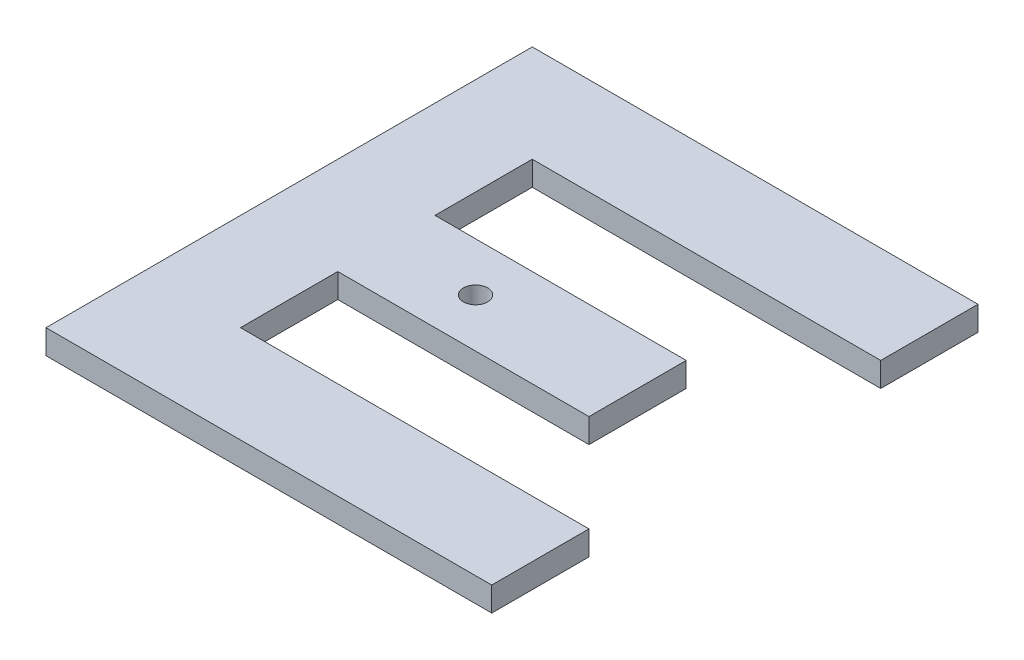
ISO-10303-21;
HEADER;
FILE_DESCRIPTION(('STEP AP214'),'2;1');
FILE_NAME('part.step','',(''),(''),'','','');
FILE_SCHEMA(('AUTOMOTIVE_DESIGN { 1 0 10303 214 1 1 1 1 }'));
ENDSEC;
DATA;
#1=APPLICATION_CONTEXT('core data for automotive mechanical design processes');
#2=APPLICATION_PROTOCOL_DEFINITION('international standard','automotive_design',2000,#1);
#3=PRODUCT_CONTEXT('',#1,'mechanical');
#4=PRODUCT('Part','Part','',(#3));
#5=PRODUCT_RELATED_PRODUCT_CATEGORY('part','',(#4));
#6=PRODUCT_DEFINITION_FORMATION('','',#4);
#7=PRODUCT_DEFINITION_CONTEXT('part definition',#1,'design');
#8=PRODUCT_DEFINITION('design','',#6,#7);
#9=PRODUCT_DEFINITION_SHAPE('','',#8);
#10=(LENGTH_UNIT() NAMED_UNIT(*) SI_UNIT(.MILLI.,.METRE.));
#11=(NAMED_UNIT(*) PLANE_ANGLE_UNIT() SI_UNIT($,.RADIAN.));
#12=(NAMED_UNIT(*) SI_UNIT($,.STERADIAN.) SOLID_ANGLE_UNIT());
#13=UNCERTAINTY_MEASURE_WITH_UNIT(LENGTH_MEASURE(1.E-05),#10,'distance_accuracy_value','');
#14=(GEOMETRIC_REPRESENTATION_CONTEXT(3) GLOBAL_UNCERTAINTY_ASSIGNED_CONTEXT((#13)) GLOBAL_UNIT_ASSIGNED_CONTEXT((#10,
#11,#12)) REPRESENTATION_CONTEXT('',''));
#15=CARTESIAN_POINT('',(0.,0.,0.));
#16=DIRECTION('',(0.,0.,1.));
#17=DIRECTION('',(1.,0.,0.));
#18=AXIS2_PLACEMENT_3D('',#15,#16,#17);
#19=CARTESIAN_POINT('',(0.,3.,-60.));
#20=DIRECTION('',(0.,-1.,0.));
#21=DIRECTION('',(0.,0.,-1.));
#22=AXIS2_PLACEMENT_3D('',#19,#20,#21);
#23=PLANE('',#22);
#24=DIRECTION('',(0.,0.,1.));
#25=VECTOR('',#24,1.);
#26=CARTESIAN_POINT('',(0.,3.,0.));
#27=LINE('',#26,#25);
#28=CARTESIAN_POINT('',(0.,3.,-60.));
#29=VERTEX_POINT('',#28);
#30=CARTESIAN_POINT('',(0.,3.,0.));
#31=VERTEX_POINT('',#30);
#32=EDGE_CURVE('E164',#29,#31,#27,.T.);
#33=ORIENTED_EDGE('',*,*,#32,.T.);
#34=DIRECTION('',(1.,0.,0.));
#35=VECTOR('',#34,1.);
#36=CARTESIAN_POINT('',(0.,3.,0.));
#37=LINE('',#36,#35);
#38=CARTESIAN_POINT('',(55.,3.,0.));
#39=VERTEX_POINT('',#38);
#40=EDGE_CURVE('E133',#31,#39,#37,.T.);
#41=ORIENTED_EDGE('',*,*,#40,.T.);
#42=DIRECTION('',(0.,0.,-1.));
#43=VECTOR('',#42,1.);
#44=CARTESIAN_POINT('',(55.,3.,0.));
#45=LINE('',#44,#43);
#46=CARTESIAN_POINT('',(55.,3.,-12.));
#47=VERTEX_POINT('',#46);
#48=EDGE_CURVE('E167',#39,#47,#45,.T.);
#49=ORIENTED_EDGE('',*,*,#48,.T.);
#50=DIRECTION('',(-1.,0.,0.));
#51=VECTOR('',#50,1.);
#52=CARTESIAN_POINT('',(12.,3.,-12.));
#53=LINE('',#52,#51);
#54=CARTESIAN_POINT('',(12.,3.,-12.));
#55=VERTEX_POINT('',#54);
#56=EDGE_CURVE('E169',#47,#55,#53,.T.);
#57=ORIENTED_EDGE('',*,*,#56,.T.);
#58=DIRECTION('',(0.,0.,-1.));
#59=VECTOR('',#58,1.);
#60=CARTESIAN_POINT('',(12.,3.,-12.));
#61=LINE('',#60,#59);
#62=CARTESIAN_POINT('',(12.,3.,-24.));
#63=VERTEX_POINT('',#62);
#64=EDGE_CURVE('E171',#55,#63,#61,.T.);
#65=ORIENTED_EDGE('',*,*,#64,.T.);
#66=DIRECTION('',(1.,0.,0.));
#67=VECTOR('',#66,1.);
#68=CARTESIAN_POINT('',(12.,3.,-24.));
#69=LINE('',#68,#67);
#70=CARTESIAN_POINT('',(43.,3.,-24.));
#71=VERTEX_POINT('',#70);
#72=EDGE_CURVE('E173',#63,#71,#69,.T.);
#73=ORIENTED_EDGE('',*,*,#72,.T.);
#74=DIRECTION('',(0.,0.,-1.));
#75=VECTOR('',#74,1.);
#76=CARTESIAN_POINT('',(43.,3.,-24.));
#77=LINE('',#76,#75);
#78=CARTESIAN_POINT('',(43.,3.,-36.));
#79=VERTEX_POINT('',#78);
#80=EDGE_CURVE('E175',#71,#79,#77,.T.);
#81=ORIENTED_EDGE('',*,*,#80,.T.);
#82=DIRECTION('',(-1.,0.,0.));
#83=VECTOR('',#82,1.);
#84=CARTESIAN_POINT('',(12.,3.,-36.));
#85=LINE('',#84,#83);
#86=CARTESIAN_POINT('',(12.,3.,-36.));
#87=VERTEX_POINT('',#86);
#88=EDGE_CURVE('E177',#79,#87,#85,.T.);
#89=ORIENTED_EDGE('',*,*,#88,.T.);
#90=DIRECTION('',(0.,0.,-1.));
#91=VECTOR('',#90,1.);
#92=CARTESIAN_POINT('',(12.,3.,-36.));
#93=LINE('',#92,#91);
#94=CARTESIAN_POINT('',(12.,3.,-48.));
#95=VERTEX_POINT('',#94);
#96=EDGE_CURVE('E179',#87,#95,#93,.T.);
#97=ORIENTED_EDGE('',*,*,#96,.T.);
#98=DIRECTION('',(1.,0.,0.));
#99=VECTOR('',#98,1.);
#100=CARTESIAN_POINT('',(12.,3.,-48.));
#101=LINE('',#100,#99);
#102=CARTESIAN_POINT('',(55.,3.,-48.));
#103=VERTEX_POINT('',#102);
#104=EDGE_CURVE('E181',#95,#103,#101,.T.);
#105=ORIENTED_EDGE('',*,*,#104,.T.);
#106=DIRECTION('',(0.,0.,-1.));
#107=VECTOR('',#106,1.);
#108=CARTESIAN_POINT('',(55.,3.,-48.));
#109=LINE('',#108,#107);
#110=CARTESIAN_POINT('',(55.,3.,-60.));
#111=VERTEX_POINT('',#110);
#112=EDGE_CURVE('E50',#103,#111,#109,.T.);
#113=ORIENTED_EDGE('',*,*,#112,.T.);
#114=DIRECTION('',(-1.,0.,0.));
#115=VECTOR('',#114,1.);
#116=CARTESIAN_POINT('',(0.,3.,-60.));
#117=LINE('',#116,#115);
#118=EDGE_CURVE('E45',#111,#29,#117,.T.);
#119=ORIENTED_EDGE('',*,*,#118,.T.);
#120=EDGE_LOOP('',(#33,#41,#49,#57,#65,#73,#81,#89,#97,#105,#113,#119));
#121=FACE_BOUND('',#120,.T.);
#122=CARTESIAN_POINT('',(23.,3.,-30.));
#123=DIRECTION('',(0.,1.,0.));
#124=DIRECTION('',(0.,0.,1.));
#125=AXIS2_PLACEMENT_3D('',#122,#123,#124);
#126=CIRCLE('',#125,1.5);
#127=CARTESIAN_POINT('',(23.,3.,-28.5));
#128=VERTEX_POINT('',#127);
#129=EDGE_CURVE('E138',#128,#128,#126,.T.);
#130=ORIENTED_EDGE('',*,*,#129,.F.);
#131=EDGE_LOOP('',(#130));
#132=FACE_BOUND('',#131,.T.);
#133=ADVANCED_FACE('F30',(#121,#132),#23,.F.);
#134=CARTESIAN_POINT('',(0.,0.,-60.));
#135=DIRECTION('',(0.,-1.,0.));
#136=DIRECTION('',(0.,0.,-1.));
#137=AXIS2_PLACEMENT_3D('',#134,#135,#136);
#138=PLANE('',#137);
#139=DIRECTION('',(0.,0.,1.));
#140=VECTOR('',#139,1.);
#141=CARTESIAN_POINT('',(0.,0.,0.));
#142=LINE('',#141,#140);
#143=CARTESIAN_POINT('',(0.,0.,-60.));
#144=VERTEX_POINT('',#143);
#145=CARTESIAN_POINT('',(0.,0.,0.));
#146=VERTEX_POINT('',#145);
#147=EDGE_CURVE('E124',#144,#146,#142,.T.);
#148=ORIENTED_EDGE('',*,*,#147,.F.);
#149=DIRECTION('',(-1.,0.,0.));
#150=VECTOR('',#149,1.);
#151=CARTESIAN_POINT('',(0.,0.,-60.));
#152=LINE('',#151,#150);
#153=CARTESIAN_POINT('',(55.,0.,-60.));
#154=VERTEX_POINT('',#153);
#155=EDGE_CURVE('E162',#154,#144,#152,.T.);
#156=ORIENTED_EDGE('',*,*,#155,.F.);
#157=DIRECTION('',(0.,0.,-1.));
#158=VECTOR('',#157,1.);
#159=CARTESIAN_POINT('',(55.,0.,-48.));
#160=LINE('',#159,#158);
#161=CARTESIAN_POINT('',(55.,0.,-48.));
#162=VERTEX_POINT('',#161);
#163=EDGE_CURVE('E160',#162,#154,#160,.T.);
#164=ORIENTED_EDGE('',*,*,#163,.F.);
#165=DIRECTION('',(1.,0.,0.));
#166=VECTOR('',#165,1.);
#167=CARTESIAN_POINT('',(12.,0.,-48.));
#168=LINE('',#167,#166);
#169=CARTESIAN_POINT('',(12.,0.,-48.));
#170=VERTEX_POINT('',#169);
#171=EDGE_CURVE('E158',#170,#162,#168,.T.);
#172=ORIENTED_EDGE('',*,*,#171,.F.);
#173=DIRECTION('',(0.,0.,-1.));
#174=VECTOR('',#173,1.);
#175=CARTESIAN_POINT('',(12.,0.,-36.));
#176=LINE('',#175,#174);
#177=CARTESIAN_POINT('',(12.,0.,-36.));
#178=VERTEX_POINT('',#177);
#179=EDGE_CURVE('E156',#178,#170,#176,.T.);
#180=ORIENTED_EDGE('',*,*,#179,.F.);
#181=DIRECTION('',(-1.,0.,0.));
#182=VECTOR('',#181,1.);
#183=CARTESIAN_POINT('',(12.,0.,-36.));
#184=LINE('',#183,#182);
#185=CARTESIAN_POINT('',(43.,0.,-36.));
#186=VERTEX_POINT('',#185);
#187=EDGE_CURVE('E154',#186,#178,#184,.T.);
#188=ORIENTED_EDGE('',*,*,#187,.F.);
#189=DIRECTION('',(0.,0.,-1.));
#190=VECTOR('',#189,1.);
#191=CARTESIAN_POINT('',(43.,0.,-24.));
#192=LINE('',#191,#190);
#193=CARTESIAN_POINT('',(43.,0.,-24.));
#194=VERTEX_POINT('',#193);
#195=EDGE_CURVE('E152',#194,#186,#192,.T.);
#196=ORIENTED_EDGE('',*,*,#195,.F.);
#197=DIRECTION('',(1.,0.,0.));
#198=VECTOR('',#197,1.);
#199=CARTESIAN_POINT('',(12.,0.,-24.));
#200=LINE('',#199,#198);
#201=CARTESIAN_POINT('',(12.,0.,-24.));
#202=VERTEX_POINT('',#201);
#203=EDGE_CURVE('E150',#202,#194,#200,.T.);
#204=ORIENTED_EDGE('',*,*,#203,.F.);
#205=DIRECTION('',(0.,0.,-1.));
#206=VECTOR('',#205,1.);
#207=CARTESIAN_POINT('',(12.,0.,-12.));
#208=LINE('',#207,#206);
#209=CARTESIAN_POINT('',(12.,0.,-12.));
#210=VERTEX_POINT('',#209);
#211=EDGE_CURVE('E148',#210,#202,#208,.T.);
#212=ORIENTED_EDGE('',*,*,#211,.F.);
#213=DIRECTION('',(-1.,0.,0.));
#214=VECTOR('',#213,1.);
#215=CARTESIAN_POINT('',(12.,0.,-12.));
#216=LINE('',#215,#214);
#217=CARTESIAN_POINT('',(55.,0.,-12.));
#218=VERTEX_POINT('',#217);
#219=EDGE_CURVE('E146',#218,#210,#216,.T.);
#220=ORIENTED_EDGE('',*,*,#219,.F.);
#221=DIRECTION('',(0.,0.,-1.));
#222=VECTOR('',#221,1.);
#223=CARTESIAN_POINT('',(55.,0.,0.));
#224=LINE('',#223,#222);
#225=CARTESIAN_POINT('',(55.,0.,0.));
#226=VERTEX_POINT('',#225);
#227=EDGE_CURVE('E126',#226,#218,#224,.T.);
#228=ORIENTED_EDGE('',*,*,#227,.F.);
#229=DIRECTION('',(1.,0.,0.));
#230=VECTOR('',#229,1.);
#231=CARTESIAN_POINT('',(0.,0.,0.));
#232=LINE('',#231,#230);
#233=EDGE_CURVE('E119',#146,#226,#232,.T.);
#234=ORIENTED_EDGE('',*,*,#233,.F.);
#235=EDGE_LOOP('',(#148,#156,#164,#172,#180,#188,#196,#204,#212,#220,#228,#234));
#236=FACE_BOUND('',#235,.T.);
#237=CARTESIAN_POINT('',(23.,0.,-30.));
#238=DIRECTION('',(0.,1.,0.));
#239=DIRECTION('',(0.,0.,1.));
#240=AXIS2_PLACEMENT_3D('',#237,#238,#239);
#241=CIRCLE('',#240,1.5);
#242=CARTESIAN_POINT('',(23.,0.,-28.5));
#243=VERTEX_POINT('',#242);
#244=EDGE_CURVE('E141',#243,#243,#241,.T.);
#245=ORIENTED_EDGE('',*,*,#244,.T.);
#246=EDGE_LOOP('',(#245));
#247=FACE_BOUND('',#246,.T.);
#248=ADVANCED_FACE('F120',(#236,#247),#138,.T.);
#249=CARTESIAN_POINT('',(0.,3.,0.));
#250=DIRECTION('',(1.,0.,0.));
#251=DIRECTION('',(0.,0.,-1.));
#252=AXIS2_PLACEMENT_3D('',#249,#250,#251);
#253=PLANE('',#252);
#254=ORIENTED_EDGE('',*,*,#147,.T.);
#255=DIRECTION('',(0.,-1.,0.));
#256=VECTOR('',#255,1.);
#257=CARTESIAN_POINT('',(0.,3.,0.));
#258=LINE('',#257,#256);
#259=EDGE_CURVE('E11',#31,#146,#258,.T.);
#260=ORIENTED_EDGE('',*,*,#259,.F.);
#261=ORIENTED_EDGE('',*,*,#32,.F.);
#262=DIRECTION('',(0.,-1.,0.));
#263=VECTOR('',#262,1.);
#264=CARTESIAN_POINT('',(0.,3.,-60.));
#265=LINE('',#264,#263);
#266=EDGE_CURVE('E137',#29,#144,#265,.T.);
#267=ORIENTED_EDGE('',*,*,#266,.T.);
#268=EDGE_LOOP('',(#254,#260,#261,#267));
#269=FACE_BOUND('',#268,.T.);
#270=ADVANCED_FACE('F32',(#269),#253,.F.);
#271=CARTESIAN_POINT('',(0.,3.,0.));
#272=DIRECTION('',(0.,0.,-1.));
#273=DIRECTION('',(-1.,0.,0.));
#274=AXIS2_PLACEMENT_3D('',#271,#272,#273);
#275=PLANE('',#274);
#276=ORIENTED_EDGE('',*,*,#233,.T.);
#277=DIRECTION('',(0.,-1.,0.));
#278=VECTOR('',#277,1.);
#279=CARTESIAN_POINT('',(55.,3.,0.));
#280=LINE('',#279,#278);
#281=EDGE_CURVE('E38',#39,#226,#280,.T.);
#282=ORIENTED_EDGE('',*,*,#281,.F.);
#283=ORIENTED_EDGE('',*,*,#40,.F.);
#284=ORIENTED_EDGE('',*,*,#259,.T.);
#285=EDGE_LOOP('',(#276,#282,#283,#284));
#286=FACE_BOUND('',#285,.T.);
#287=ADVANCED_FACE('F132',(#286),#275,.F.);
#288=CARTESIAN_POINT('',(55.,3.,0.));
#289=DIRECTION('',(-1.,0.,0.));
#290=DIRECTION('',(0.,0.,1.));
#291=AXIS2_PLACEMENT_3D('',#288,#289,#290);
#292=PLANE('',#291);
#293=ORIENTED_EDGE('',*,*,#227,.T.);
#294=DIRECTION('',(0.,-1.,0.));
#295=VECTOR('',#294,1.);
#296=CARTESIAN_POINT('',(55.,3.,-12.));
#297=LINE('',#296,#295);
#298=EDGE_CURVE('E210',#47,#218,#297,.T.);
#299=ORIENTED_EDGE('',*,*,#298,.F.);
#300=ORIENTED_EDGE('',*,*,#48,.F.);
#301=ORIENTED_EDGE('',*,*,#281,.T.);
#302=EDGE_LOOP('',(#293,#299,#300,#301));
#303=FACE_BOUND('',#302,.T.);
#304=ADVANCED_FACE('F214',(#303),#292,.F.);
#305=CARTESIAN_POINT('',(12.,3.,-12.));
#306=DIRECTION('',(0.,0.,1.));
#307=DIRECTION('',(1.,0.,0.));
#308=AXIS2_PLACEMENT_3D('',#305,#306,#307);
#309=PLANE('',#308);
#310=ORIENTED_EDGE('',*,*,#219,.T.);
#311=DIRECTION('',(0.,-1.,0.));
#312=VECTOR('',#311,1.);
#313=CARTESIAN_POINT('',(12.,3.,-12.));
#314=LINE('',#313,#312);
#315=EDGE_CURVE('E207',#55,#210,#314,.T.);
#316=ORIENTED_EDGE('',*,*,#315,.F.);
#317=ORIENTED_EDGE('',*,*,#56,.F.);
#318=ORIENTED_EDGE('',*,*,#298,.T.);
#319=EDGE_LOOP('',(#310,#316,#317,#318));
#320=FACE_BOUND('',#319,.T.);
#321=ADVANCED_FACE('F222',(#320),#309,.F.);
#322=CARTESIAN_POINT('',(12.,3.,-12.));
#323=DIRECTION('',(-1.,0.,0.));
#324=DIRECTION('',(0.,0.,1.));
#325=AXIS2_PLACEMENT_3D('',#322,#323,#324);
#326=PLANE('',#325);
#327=ORIENTED_EDGE('',*,*,#211,.T.);
#328=DIRECTION('',(0.,-1.,0.));
#329=VECTOR('',#328,1.);
#330=CARTESIAN_POINT('',(12.,3.,-24.));
#331=LINE('',#330,#329);
#332=EDGE_CURVE('E204',#63,#202,#331,.T.);
#333=ORIENTED_EDGE('',*,*,#332,.F.);
#334=ORIENTED_EDGE('',*,*,#64,.F.);
#335=ORIENTED_EDGE('',*,*,#315,.T.);
#336=EDGE_LOOP('',(#327,#333,#334,#335));
#337=FACE_BOUND('',#336,.T.);
#338=ADVANCED_FACE('F225',(#337),#326,.F.);
#339=CARTESIAN_POINT('',(12.,3.,-24.));
#340=DIRECTION('',(0.,0.,-1.));
#341=DIRECTION('',(-1.,0.,0.));
#342=AXIS2_PLACEMENT_3D('',#339,#340,#341);
#343=PLANE('',#342);
#344=ORIENTED_EDGE('',*,*,#203,.T.);
#345=DIRECTION('',(0.,-1.,0.));
#346=VECTOR('',#345,1.);
#347=CARTESIAN_POINT('',(43.,3.,-24.));
#348=LINE('',#347,#346);
#349=EDGE_CURVE('E201',#71,#194,#348,.T.);
#350=ORIENTED_EDGE('',*,*,#349,.F.);
#351=ORIENTED_EDGE('',*,*,#72,.F.);
#352=ORIENTED_EDGE('',*,*,#332,.T.);
#353=EDGE_LOOP('',(#344,#350,#351,#352));
#354=FACE_BOUND('',#353,.T.);
#355=ADVANCED_FACE('F230',(#354),#343,.F.);
#356=CARTESIAN_POINT('',(43.,3.,-24.));
#357=DIRECTION('',(-1.,0.,0.));
#358=DIRECTION('',(0.,0.,1.));
#359=AXIS2_PLACEMENT_3D('',#356,#357,#358);
#360=PLANE('',#359);
#361=ORIENTED_EDGE('',*,*,#195,.T.);
#362=DIRECTION('',(0.,-1.,0.));
#363=VECTOR('',#362,1.);
#364=CARTESIAN_POINT('',(43.,3.,-36.));
#365=LINE('',#364,#363);
#366=EDGE_CURVE('E198',#79,#186,#365,.T.);
#367=ORIENTED_EDGE('',*,*,#366,.F.);
#368=ORIENTED_EDGE('',*,*,#80,.F.);
#369=ORIENTED_EDGE('',*,*,#349,.T.);
#370=EDGE_LOOP('',(#361,#367,#368,#369));
#371=FACE_BOUND('',#370,.T.);
#372=ADVANCED_FACE('F236',(#371),#360,.F.);
#373=CARTESIAN_POINT('',(12.,3.,-36.));
#374=DIRECTION('',(0.,0.,1.));
#375=DIRECTION('',(1.,0.,0.));
#376=AXIS2_PLACEMENT_3D('',#373,#374,#375);
#377=PLANE('',#376);
#378=ORIENTED_EDGE('',*,*,#187,.T.);
#379=DIRECTION('',(0.,-1.,0.));
#380=VECTOR('',#379,1.);
#381=CARTESIAN_POINT('',(12.,3.,-36.));
#382=LINE('',#381,#380);
#383=EDGE_CURVE('E195',#87,#178,#382,.T.);
#384=ORIENTED_EDGE('',*,*,#383,.F.);
#385=ORIENTED_EDGE('',*,*,#88,.F.);
#386=ORIENTED_EDGE('',*,*,#366,.T.);
#387=EDGE_LOOP('',(#378,#384,#385,#386));
#388=FACE_BOUND('',#387,.T.);
#389=ADVANCED_FACE('F240',(#388),#377,.F.);
#390=CARTESIAN_POINT('',(12.,3.,-36.));
#391=DIRECTION('',(-1.,0.,0.));
#392=DIRECTION('',(0.,0.,1.));
#393=AXIS2_PLACEMENT_3D('',#390,#391,#392);
#394=PLANE('',#393);
#395=ORIENTED_EDGE('',*,*,#179,.T.);
#396=DIRECTION('',(0.,-1.,0.));
#397=VECTOR('',#396,1.);
#398=CARTESIAN_POINT('',(12.,3.,-48.));
#399=LINE('',#398,#397);
#400=EDGE_CURVE('E192',#95,#170,#399,.T.);
#401=ORIENTED_EDGE('',*,*,#400,.F.);
#402=ORIENTED_EDGE('',*,*,#96,.F.);
#403=ORIENTED_EDGE('',*,*,#383,.T.);
#404=EDGE_LOOP('',(#395,#401,#402,#403));
#405=FACE_BOUND('',#404,.T.);
#406=ADVANCED_FACE('F245',(#405),#394,.F.);
#407=CARTESIAN_POINT('',(12.,3.,-48.));
#408=DIRECTION('',(0.,0.,-1.));
#409=DIRECTION('',(-1.,0.,0.));
#410=AXIS2_PLACEMENT_3D('',#407,#408,#409);
#411=PLANE('',#410);
#412=ORIENTED_EDGE('',*,*,#171,.T.);
#413=DIRECTION('',(0.,-1.,0.));
#414=VECTOR('',#413,1.);
#415=CARTESIAN_POINT('',(55.,3.,-48.));
#416=LINE('',#415,#414);
#417=EDGE_CURVE('E189',#103,#162,#416,.T.);
#418=ORIENTED_EDGE('',*,*,#417,.F.);
#419=ORIENTED_EDGE('',*,*,#104,.F.);
#420=ORIENTED_EDGE('',*,*,#400,.T.);
#421=EDGE_LOOP('',(#412,#418,#419,#420));
#422=FACE_BOUND('',#421,.T.);
#423=ADVANCED_FACE('F249',(#422),#411,.F.);
#424=CARTESIAN_POINT('',(55.,3.,-48.));
#425=DIRECTION('',(-1.,0.,0.));
#426=DIRECTION('',(0.,0.,1.));
#427=AXIS2_PLACEMENT_3D('',#424,#425,#426);
#428=PLANE('',#427);
#429=ORIENTED_EDGE('',*,*,#163,.T.);
#430=DIRECTION('',(0.,-1.,0.));
#431=VECTOR('',#430,1.);
#432=CARTESIAN_POINT('',(55.,3.,-60.));
#433=LINE('',#432,#431);
#434=EDGE_CURVE('E186',#111,#154,#433,.T.);
#435=ORIENTED_EDGE('',*,*,#434,.F.);
#436=ORIENTED_EDGE('',*,*,#112,.F.);
#437=ORIENTED_EDGE('',*,*,#417,.T.);
#438=EDGE_LOOP('',(#429,#435,#436,#437));
#439=FACE_BOUND('',#438,.T.);
#440=ADVANCED_FACE('F253',(#439),#428,.F.);
#441=CARTESIAN_POINT('',(0.,3.,-60.));
#442=DIRECTION('',(0.,0.,1.));
#443=DIRECTION('',(1.,0.,0.));
#444=AXIS2_PLACEMENT_3D('',#441,#442,#443);
#445=PLANE('',#444);
#446=ORIENTED_EDGE('',*,*,#155,.T.);
#447=ORIENTED_EDGE('',*,*,#266,.F.);
#448=ORIENTED_EDGE('',*,*,#118,.F.);
#449=ORIENTED_EDGE('',*,*,#434,.T.);
#450=EDGE_LOOP('',(#446,#447,#448,#449));
#451=FACE_BOUND('',#450,.T.);
#452=ADVANCED_FACE('F255',(#451),#445,.F.);
#453=CARTESIAN_POINT('',(23.,3.,-30.));
#454=DIRECTION('',(0.,-1.,0.));
#455=DIRECTION('',(0.,0.,-1.));
#456=AXIS2_PLACEMENT_3D('',#453,#454,#455);
#457=CYLINDRICAL_SURFACE('',#456,1.5);
#458=ORIENTED_EDGE('',*,*,#129,.T.);
#459=EDGE_LOOP('',(#458));
#460=FACE_BOUND('',#459,.T.);
#461=ORIENTED_EDGE('',*,*,#244,.F.);
#462=EDGE_LOOP('',(#461));
#463=FACE_BOUND('',#462,.T.);
#464=ADVANCED_FACE('F257',(#460,#463),#457,.F.);
#465=CLOSED_SHELL('',(#133,#248,#270,#287,#304,#321,#338,#355,#372,#389,#406,#423,#440,#452,#464));
#466=MANIFOLD_SOLID_BREP('B2',#465);
#467=ADVANCED_BREP_SHAPE_REPRESENTATION('',(#18,#466),#14);
#468=SHAPE_DEFINITION_REPRESENTATION(#9,#467);
ENDSEC;
END-ISO-10303-21;
